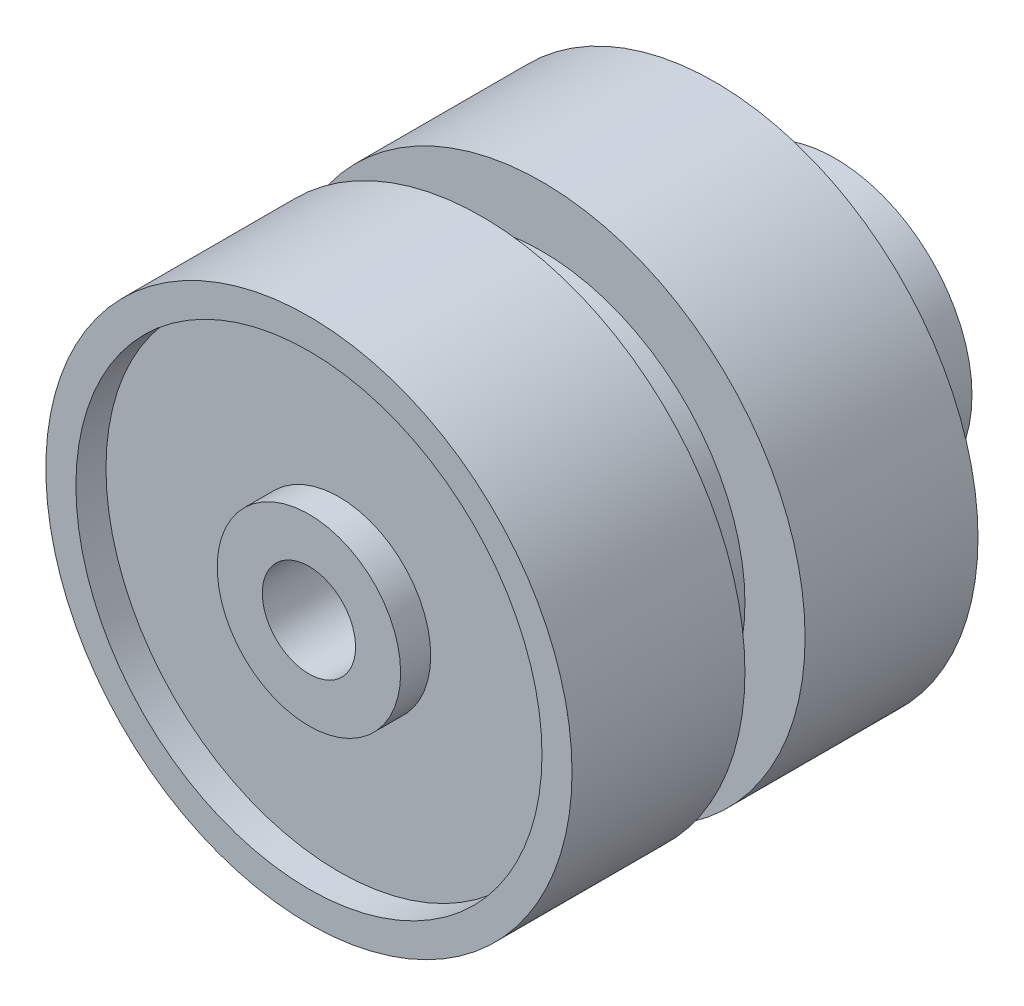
from build123d import *

# Parameters (mm, degrees)
ESQUISSE3_R             = 7.75
ESQUISSE3_R_2           = 3.05
ENL_V_MAT_EXTRU_1_DEPTH = 1
BOSS_EXTRU_1_START      = 4
ESQUISSE4_R             = 4.55
ESQUISSE4_R_2           = 1.55
BOSS_EXTRU_1_DEPTH      = 4


with BuildPart() as part:
    # Esquisse2 → R_volution1 (revolve)
    with BuildSketch(Plane(origin=(0, 0, 0), x_dir=(0, 0, -1), z_dir=(1, 0, 0)), mode=Mode.PRIVATE) as r_volution1_sk:
        Polygon((-6.75, 8.75), (-6.75, 1.55), (6.75, 1.55), (6.75, 8.75), (1, 8.75), (1, 6.75), (-1, 6.75), (-1, 8.75), align=None)
    revolve(r_volution1_sk.sketch.rotate(Axis((0, 0, 15.787769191), (0, 0, -1)), 90), axis=Axis((0, 0, 15.787769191), (0, 0, -1)))

    # Esquisse3 → Enl_v. mat.-Extru.1 (cut)
    with BuildSketch(Plane.XY.offset(6.75)):
        Circle(ESQUISSE3_R)
        Circle(ESQUISSE3_R_2, mode=Mode.SUBTRACT)
    extrude(amount=-ENL_V_MAT_EXTRU_1_DEPTH, mode=Mode.SUBTRACT)

    # Esquisse4 → Boss.-Extru.1 (add)
    with BuildSketch(Plane(origin=(0, 0, -6.75), x_dir=(-1, 0, 0), z_dir=(0, 0, -1)).offset(BOSS_EXTRU_1_START)):
        with Locations(Location((0, 0, 0), (0, 0, 180))):
            Circle(ESQUISSE4_R)
        with Locations(Location((0, 0, 0), (0, 0, 180))):
            Circle(ESQUISSE4_R_2, mode=Mode.SUBTRACT)
    extrude(amount=-BOSS_EXTRU_1_DEPTH)


solid = part.part
